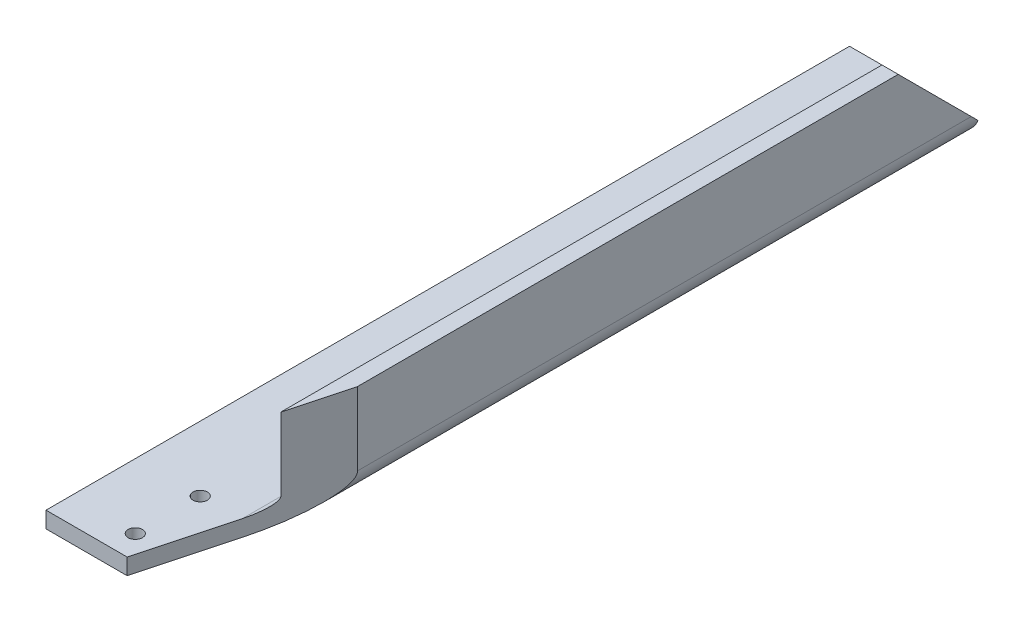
from build123d import *

# Parameters (mm, degrees)
BASE_EXTRUDE_DEPTH = 314.325
SKETCH2_R          = 2.286
SKETCH2_R_2        = 2.794
CUT_EXTRUDE1_DEPTH = 38.1
CUT_EXTRUDE3_DEPTH = 38.1
CUT_EXTRUDE4_DEPTH = 321.675


with BuildPart() as part:
    # Sketch1 → Base-Extrude (new body)
    with BuildSketch(Plane.XY):
        with BuildLine():
            Line((-25.4, 0), (-25.4, 6.35))
            Line((-25.4, 6.35), (15.875, 6.35))
            ThreePointArc((15.875, 6.35), (18.12006403, 7.27993597), (19.05, 9.525))
            Line((19.05, 9.525), (19.05, 38.1))
            Line((19.05, 38.1), (25.4, 38.1))
            Line((25.4, 38.1), (25.4, 9.525))
            ThreePointArc((25.4, 9.525), (22.610192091, 2.789807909), (15.875, 0))
            Line((15.875, 0), (-25.4, 0))
        make_face()
    extrude(amount=BASE_EXTRUDE_DEPTH)

    # Sketch2 → Cut-Extrude1 (cut, symmetric)
    with BuildSketch(Plane(origin=(0, 6.35, 0), x_dir=(-1, 0, 0), z_dir=(0, 1, 0))):
        with Locations(Location((6.35, 22.6314, 0), (0, 0, 90))):
            Circle(SKETCH2_R)
        with Locations(Location((-6.35, 22.6314, 0), (0, 0, 90))):
            Circle(SKETCH2_R)
        with Locations(Location((-6.35, 5.1562, 0), (0, 0, 90))):
            Circle(SKETCH2_R)
        with Locations(Location((6.35, 5.1562, 0), (0, 0, 90))):
            Circle(SKETCH2_R)
        with Locations(Location((0, 304.8, 0), (0, 0, 90))):
            Circle(SKETCH2_R_2)
        with Locations(Location((0, 279.4, 0), (0, 0, 90))):
            Circle(SKETCH2_R_2)
        Polygon((-6.35, 314.325), (-38.1, 314.325), (-38.1, 195.83238686), align=None)
    extrude(amount=CUT_EXTRUDE1_DEPTH, both=True, mode=Mode.SUBTRACT)

    # Sketch4 → Cut-Extrude3 (cut)
    with BuildSketch(Plane(origin=(0, 0, 0), x_dir=(-1, 0, 0), z_dir=(0, 0, -1))):
        with BuildLine():
            Line((25.4, 6.35), (25.4, 0))
            Line((25.4, 0), (19.05, 0))
            ThreePointArc((19.05, 0), (23.540128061, 1.859871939), (25.4, 6.35))
        make_face()
    extrude(amount=-CUT_EXTRUDE3_DEPTH, mode=Mode.SUBTRACT)

    # Sketch5 → Cut-Extrude4 (cut, through all)
    with BuildSketch(Plane(origin=(25.4, 0, 0), x_dir=(0, 0, -1), z_dir=(1, 0, 0))):
        Polygon((0, 6.35), (-31.75, 38.1), (0, 38.1), align=None)
    extrude(amount=-CUT_EXTRUDE4_DEPTH, mode=Mode.SUBTRACT)


solid = part.part
